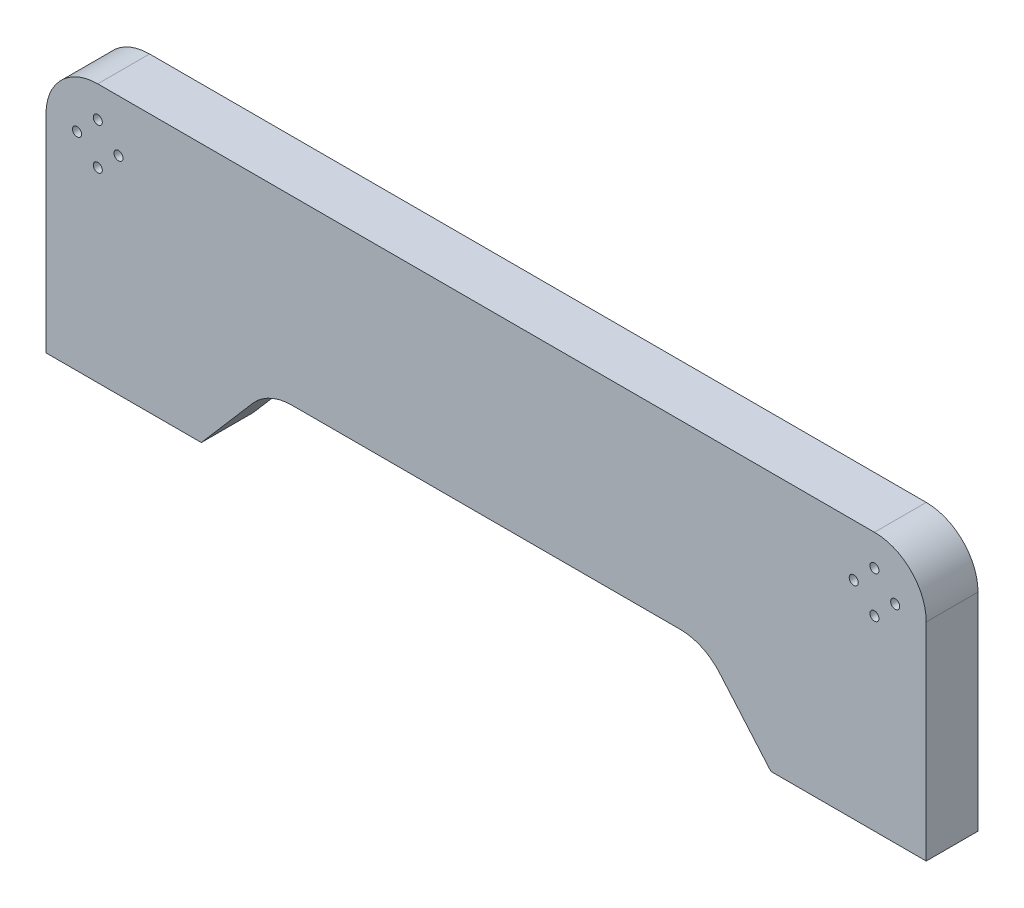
ISO-10303-21;
HEADER;
FILE_DESCRIPTION(('STEP AP214'),'2;1');
FILE_NAME('part.step','',(''),(''),'','','');
FILE_SCHEMA(('AUTOMOTIVE_DESIGN { 1 0 10303 214 1 1 1 1 }'));
ENDSEC;
DATA;
#1=APPLICATION_CONTEXT('core data for automotive mechanical design processes');
#2=APPLICATION_PROTOCOL_DEFINITION('international standard','automotive_design',2000,#1);
#3=PRODUCT_CONTEXT('',#1,'mechanical');
#4=PRODUCT('Part','Part','',(#3));
#5=PRODUCT_RELATED_PRODUCT_CATEGORY('part','',(#4));
#6=PRODUCT_DEFINITION_FORMATION('','',#4);
#7=PRODUCT_DEFINITION_CONTEXT('part definition',#1,'design');
#8=PRODUCT_DEFINITION('design','',#6,#7);
#9=PRODUCT_DEFINITION_SHAPE('','',#8);
#10=(LENGTH_UNIT() NAMED_UNIT(*) SI_UNIT(.MILLI.,.METRE.));
#11=(NAMED_UNIT(*) PLANE_ANGLE_UNIT() SI_UNIT($,.RADIAN.));
#12=(NAMED_UNIT(*) SI_UNIT($,.STERADIAN.) SOLID_ANGLE_UNIT());
#13=UNCERTAINTY_MEASURE_WITH_UNIT(LENGTH_MEASURE(1.E-05),#10,'distance_accuracy_value','');
#14=(GEOMETRIC_REPRESENTATION_CONTEXT(3) GLOBAL_UNCERTAINTY_ASSIGNED_CONTEXT((#13)) GLOBAL_UNIT_ASSIGNED_CONTEXT((#10,
#11,#12)) REPRESENTATION_CONTEXT('',''));
#15=CARTESIAN_POINT('',(0.,0.,0.));
#16=DIRECTION('',(0.,0.,1.));
#17=DIRECTION('',(1.,0.,0.));
#18=AXIS2_PLACEMENT_3D('',#15,#16,#17);
#19=CARTESIAN_POINT('',(95.,9.99999999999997,20.));
#20=DIRECTION('',(0.,0.,-1.));
#21=DIRECTION('',(-1.,0.,0.));
#22=AXIS2_PLACEMENT_3D('',#19,#20,#21);
#23=PLANE('',#22);
#24=DIRECTION('',(0.,-1.,0.));
#25=VECTOR('',#24,1.);
#26=CARTESIAN_POINT('',(0.,80.,20.));
#27=LINE('',#26,#25);
#28=CARTESIAN_POINT('',(0.,80.,20.));
#29=VERTEX_POINT('',#28);
#30=CARTESIAN_POINT('',(0.,0.,20.));
#31=VERTEX_POINT('',#30);
#32=EDGE_CURVE('E206',#29,#31,#27,.T.);
#33=ORIENTED_EDGE('',*,*,#32,.T.);
#34=DIRECTION('',(1.,0.,0.));
#35=VECTOR('',#34,1.);
#36=CARTESIAN_POINT('',(0.,0.,20.));
#37=LINE('',#36,#35);
#38=CARTESIAN_POINT('',(60.,0.,20.));
#39=VERTEX_POINT('',#38);
#40=EDGE_CURVE('E118',#31,#39,#37,.T.);
#41=ORIENTED_EDGE('',*,*,#40,.T.);
#42=DIRECTION('',(0.652440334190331,0.757840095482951,0.));
#43=VECTOR('',#42,1.);
#44=CARTESIAN_POINT('',(60.,0.,20.));
#45=LINE('',#44,#43);
#46=CARTESIAN_POINT('',(79.843198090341,23.0488066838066,20.));
#47=VERTEX_POINT('',#46);
#48=EDGE_CURVE('E243',#39,#47,#45,.T.);
#49=ORIENTED_EDGE('',*,*,#48,.T.);
#50=CARTESIAN_POINT('',(95.,9.99999999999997,20.));
#51=DIRECTION('',(0.,0.,-1.));
#52=DIRECTION('',(-1.,0.,0.));
#53=AXIS2_PLACEMENT_3D('',#50,#51,#52);
#54=CIRCLE('',#53,20.);
#55=CARTESIAN_POINT('',(95.,30.,20.));
#56=VERTEX_POINT('',#55);
#57=EDGE_CURVE('E263',#47,#56,#54,.T.);
#58=ORIENTED_EDGE('',*,*,#57,.T.);
#59=DIRECTION('',(1.,0.,0.));
#60=VECTOR('',#59,1.);
#61=CARTESIAN_POINT('',(95.,30.,20.));
#62=LINE('',#61,#60);
#63=CARTESIAN_POINT('',(245.,30.,20.));
#64=VERTEX_POINT('',#63);
#65=EDGE_CURVE('E259',#56,#64,#62,.T.);
#66=ORIENTED_EDGE('',*,*,#65,.T.);
#67=CARTESIAN_POINT('',(245.,9.99999999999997,20.));
#68=DIRECTION('',(0.,0.,-1.));
#69=DIRECTION('',(-1.,0.,0.));
#70=AXIS2_PLACEMENT_3D('',#67,#68,#69);
#71=CIRCLE('',#70,20.);
#72=CARTESIAN_POINT('',(260.156801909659,23.0488066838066,20.));
#73=VERTEX_POINT('',#72);
#74=EDGE_CURVE('E262',#64,#73,#71,.T.);
#75=ORIENTED_EDGE('',*,*,#74,.T.);
#76=DIRECTION('',(0.652440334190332,-0.757840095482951,0.));
#77=VECTOR('',#76,1.);
#78=CARTESIAN_POINT('',(260.156801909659,23.0488066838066,20.));
#79=LINE('',#78,#77);
#80=CARTESIAN_POINT('',(280.,0.,20.));
#81=VERTEX_POINT('',#80);
#82=EDGE_CURVE('E267',#73,#81,#79,.T.);
#83=ORIENTED_EDGE('',*,*,#82,.T.);
#84=DIRECTION('',(1.,0.,0.));
#85=VECTOR('',#84,1.);
#86=CARTESIAN_POINT('',(280.,0.,20.));
#87=LINE('',#86,#85);
#88=CARTESIAN_POINT('',(340.,0.,20.));
#89=VERTEX_POINT('',#88);
#90=EDGE_CURVE('E274',#81,#89,#87,.T.);
#91=ORIENTED_EDGE('',*,*,#90,.T.);
#92=DIRECTION('',(0.,1.,0.));
#93=VECTOR('',#92,1.);
#94=CARTESIAN_POINT('',(340.,0.,20.));
#95=LINE('',#94,#93);
#96=CARTESIAN_POINT('',(340.,80.,20.));
#97=VERTEX_POINT('',#96);
#98=EDGE_CURVE('E149',#89,#97,#95,.T.);
#99=ORIENTED_EDGE('',*,*,#98,.T.);
#100=CARTESIAN_POINT('',(320.,80.,20.));
#101=DIRECTION('',(0.,0.,1.));
#102=DIRECTION('',(1.,0.,0.));
#103=AXIS2_PLACEMENT_3D('',#100,#101,#102);
#104=CIRCLE('',#103,19.9999999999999);
#105=CARTESIAN_POINT('',(320.,100.,20.));
#106=VERTEX_POINT('',#105);
#107=EDGE_CURVE('E143',#97,#106,#104,.T.);
#108=ORIENTED_EDGE('',*,*,#107,.T.);
#109=DIRECTION('',(-1.,0.,0.));
#110=VECTOR('',#109,1.);
#111=CARTESIAN_POINT('',(320.,100.,20.));
#112=LINE('',#111,#110);
#113=CARTESIAN_POINT('',(20.,100.,20.));
#114=VERTEX_POINT('',#113);
#115=EDGE_CURVE('E147',#106,#114,#112,.T.);
#116=ORIENTED_EDGE('',*,*,#115,.T.);
#117=CARTESIAN_POINT('',(20.,80.,20.));
#118=DIRECTION('',(0.,0.,1.));
#119=DIRECTION('',(1.,0.,0.));
#120=AXIS2_PLACEMENT_3D('',#117,#118,#119);
#121=CIRCLE('',#120,20.);
#122=EDGE_CURVE('E63',#114,#29,#121,.T.);
#123=ORIENTED_EDGE('',*,*,#122,.T.);
#124=EDGE_LOOP('',(#33,#41,#49,#58,#66,#75,#83,#91,#99,#108,#116,#123));
#125=FACE_BOUND('',#124,.T.);
#126=CARTESIAN_POINT('',(12.,80.,20.));
#127=DIRECTION('',(0.,0.,1.));
#128=DIRECTION('',(1.,0.,0.));
#129=AXIS2_PLACEMENT_3D('',#126,#127,#128);
#130=CIRCLE('',#129,1.75);
#131=CARTESIAN_POINT('',(13.75,80.,20.));
#132=VERTEX_POINT('',#131);
#133=EDGE_CURVE('E176',#132,#132,#130,.T.);
#134=ORIENTED_EDGE('',*,*,#133,.F.);
#135=EDGE_LOOP('',(#134));
#136=FACE_BOUND('',#135,.T.);
#137=CARTESIAN_POINT('',(320.,88.,20.));
#138=DIRECTION('',(0.,0.,1.));
#139=DIRECTION('',(-1.,0.,0.));
#140=AXIS2_PLACEMENT_3D('',#137,#138,#139);
#141=CIRCLE('',#140,1.75);
#142=CARTESIAN_POINT('',(318.25,88.,20.));
#143=VERTEX_POINT('',#142);
#144=EDGE_CURVE('E392',#143,#143,#141,.T.);
#145=ORIENTED_EDGE('',*,*,#144,.F.);
#146=EDGE_LOOP('',(#145));
#147=FACE_BOUND('',#146,.T.);
#148=CARTESIAN_POINT('',(328.,80.,20.));
#149=DIRECTION('',(0.,0.,1.));
#150=DIRECTION('',(-1.,0.,0.));
#151=AXIS2_PLACEMENT_3D('',#148,#149,#150);
#152=CIRCLE('',#151,1.74999999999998);
#153=CARTESIAN_POINT('',(326.25,80.,20.));
#154=VERTEX_POINT('',#153);
#155=EDGE_CURVE('E384',#154,#154,#152,.T.);
#156=ORIENTED_EDGE('',*,*,#155,.F.);
#157=EDGE_LOOP('',(#156));
#158=FACE_BOUND('',#157,.T.);
#159=CARTESIAN_POINT('',(20.,88.,20.));
#160=DIRECTION('',(0.,0.,1.));
#161=DIRECTION('',(1.,0.,0.));
#162=AXIS2_PLACEMENT_3D('',#159,#160,#161);
#163=CIRCLE('',#162,1.75);
#164=CARTESIAN_POINT('',(21.75,88.,20.));
#165=VERTEX_POINT('',#164);
#166=EDGE_CURVE('E376',#165,#165,#163,.T.);
#167=ORIENTED_EDGE('',*,*,#166,.F.);
#168=EDGE_LOOP('',(#167));
#169=FACE_BOUND('',#168,.T.);
#170=CARTESIAN_POINT('',(28.,79.9999999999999,20.));
#171=DIRECTION('',(0.,0.,1.));
#172=DIRECTION('',(1.,0.,0.));
#173=AXIS2_PLACEMENT_3D('',#170,#171,#172);
#174=CIRCLE('',#173,1.75);
#175=CARTESIAN_POINT('',(29.75,79.9999999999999,20.));
#176=VERTEX_POINT('',#175);
#177=EDGE_CURVE('E368',#176,#176,#174,.T.);
#178=ORIENTED_EDGE('',*,*,#177,.F.);
#179=EDGE_LOOP('',(#178));
#180=FACE_BOUND('',#179,.T.);
#181=CARTESIAN_POINT('',(19.9999999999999,72.,20.));
#182=DIRECTION('',(0.,0.,1.));
#183=DIRECTION('',(1.,0.,0.));
#184=AXIS2_PLACEMENT_3D('',#181,#182,#183);
#185=CIRCLE('',#184,1.75000000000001);
#186=CARTESIAN_POINT('',(21.7499999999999,72.,20.));
#187=VERTEX_POINT('',#186);
#188=EDGE_CURVE('E360',#187,#187,#185,.T.);
#189=ORIENTED_EDGE('',*,*,#188,.F.);
#190=EDGE_LOOP('',(#189));
#191=FACE_BOUND('',#190,.T.);
#192=CARTESIAN_POINT('',(320.,72.,20.));
#193=DIRECTION('',(0.,0.,1.));
#194=DIRECTION('',(-1.,0.,0.));
#195=AXIS2_PLACEMENT_3D('',#192,#193,#194);
#196=CIRCLE('',#195,1.75000000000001);
#197=CARTESIAN_POINT('',(318.25,72.,20.));
#198=VERTEX_POINT('',#197);
#199=EDGE_CURVE('E352',#198,#198,#196,.T.);
#200=ORIENTED_EDGE('',*,*,#199,.F.);
#201=EDGE_LOOP('',(#200));
#202=FACE_BOUND('',#201,.T.);
#203=CARTESIAN_POINT('',(312.,80.,20.));
#204=DIRECTION('',(0.,0.,1.));
#205=DIRECTION('',(-1.,0.,0.));
#206=AXIS2_PLACEMENT_3D('',#203,#204,#205);
#207=CIRCLE('',#206,1.75000000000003);
#208=CARTESIAN_POINT('',(310.25,80.,20.));
#209=VERTEX_POINT('',#208);
#210=EDGE_CURVE('E341',#209,#209,#207,.T.);
#211=ORIENTED_EDGE('',*,*,#210,.F.);
#212=EDGE_LOOP('',(#211));
#213=FACE_BOUND('',#212,.T.);
#214=ADVANCED_FACE('F45',(#125,#136,#147,#158,#169,#180,#191,#202,#213),#23,.F.);
#215=CARTESIAN_POINT('',(95.,9.99999999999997,0.));
#216=DIRECTION('',(0.,0.,-1.));
#217=DIRECTION('',(-1.,0.,0.));
#218=AXIS2_PLACEMENT_3D('',#215,#216,#217);
#219=PLANE('',#218);
#220=CARTESIAN_POINT('',(320.,72.,0.));
#221=DIRECTION('',(0.,0.,1.));
#222=DIRECTION('',(-1.,0.,0.));
#223=AXIS2_PLACEMENT_3D('',#220,#221,#222);
#224=CIRCLE('',#223,1.75000000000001);
#225=CARTESIAN_POINT('',(318.25,72.,0.));
#226=VERTEX_POINT('',#225);
#227=EDGE_CURVE('E349',#226,#226,#224,.T.);
#228=ORIENTED_EDGE('',*,*,#227,.T.);
#229=EDGE_LOOP('',(#228));
#230=FACE_BOUND('',#229,.T.);
#231=CARTESIAN_POINT('',(28.,79.9999999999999,0.));
#232=DIRECTION('',(0.,0.,1.));
#233=DIRECTION('',(1.,0.,0.));
#234=AXIS2_PLACEMENT_3D('',#231,#232,#233);
#235=CIRCLE('',#234,1.75);
#236=CARTESIAN_POINT('',(29.75,79.9999999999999,0.));
#237=VERTEX_POINT('',#236);
#238=EDGE_CURVE('E364',#237,#237,#235,.T.);
#239=ORIENTED_EDGE('',*,*,#238,.T.);
#240=EDGE_LOOP('',(#239));
#241=FACE_BOUND('',#240,.T.);
#242=CARTESIAN_POINT('',(328.,80.,0.));
#243=DIRECTION('',(0.,0.,1.));
#244=DIRECTION('',(-1.,0.,0.));
#245=AXIS2_PLACEMENT_3D('',#242,#243,#244);
#246=CIRCLE('',#245,1.74999999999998);
#247=CARTESIAN_POINT('',(326.25,80.,0.));
#248=VERTEX_POINT('',#247);
#249=EDGE_CURVE('E380',#248,#248,#246,.T.);
#250=ORIENTED_EDGE('',*,*,#249,.T.);
#251=EDGE_LOOP('',(#250));
#252=FACE_BOUND('',#251,.T.);
#253=CARTESIAN_POINT('',(12.,80.,0.));
#254=DIRECTION('',(0.,0.,1.));
#255=DIRECTION('',(1.,0.,0.));
#256=AXIS2_PLACEMENT_3D('',#253,#254,#255);
#257=CIRCLE('',#256,1.75);
#258=CARTESIAN_POINT('',(13.75,80.,0.));
#259=VERTEX_POINT('',#258);
#260=EDGE_CURVE('E396',#259,#259,#257,.T.);
#261=ORIENTED_EDGE('',*,*,#260,.T.);
#262=EDGE_LOOP('',(#261));
#263=FACE_BOUND('',#262,.T.);
#264=DIRECTION('',(0.,-1.,0.));
#265=VECTOR('',#264,1.);
#266=CARTESIAN_POINT('',(0.,80.,0.));
#267=LINE('',#266,#265);
#268=CARTESIAN_POINT('',(0.,80.,0.));
#269=VERTEX_POINT('',#268);
#270=CARTESIAN_POINT('',(0.,0.,0.));
#271=VERTEX_POINT('',#270);
#272=EDGE_CURVE('E171',#269,#271,#267,.T.);
#273=ORIENTED_EDGE('',*,*,#272,.F.);
#274=CARTESIAN_POINT('',(20.,80.,0.));
#275=DIRECTION('',(0.,0.,1.));
#276=DIRECTION('',(1.,0.,0.));
#277=AXIS2_PLACEMENT_3D('',#274,#275,#276);
#278=CIRCLE('',#277,20.);
#279=CARTESIAN_POINT('',(20.,100.,0.));
#280=VERTEX_POINT('',#279);
#281=EDGE_CURVE('E110',#280,#269,#278,.T.);
#282=ORIENTED_EDGE('',*,*,#281,.F.);
#283=DIRECTION('',(-1.,0.,0.));
#284=VECTOR('',#283,1.);
#285=CARTESIAN_POINT('',(320.,100.,0.));
#286=LINE('',#285,#284);
#287=CARTESIAN_POINT('',(320.,100.,0.));
#288=VERTEX_POINT('',#287);
#289=EDGE_CURVE('E104',#288,#280,#286,.T.);
#290=ORIENTED_EDGE('',*,*,#289,.F.);
#291=CARTESIAN_POINT('',(320.,80.,0.));
#292=DIRECTION('',(0.,0.,1.));
#293=DIRECTION('',(1.,0.,0.));
#294=AXIS2_PLACEMENT_3D('',#291,#292,#293);
#295=CIRCLE('',#294,19.9999999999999);
#296=CARTESIAN_POINT('',(340.,80.,0.));
#297=VERTEX_POINT('',#296);
#298=EDGE_CURVE('E158',#297,#288,#295,.T.);
#299=ORIENTED_EDGE('',*,*,#298,.F.);
#300=DIRECTION('',(0.,1.,0.));
#301=VECTOR('',#300,1.);
#302=CARTESIAN_POINT('',(340.,0.,0.));
#303=LINE('',#302,#301);
#304=CARTESIAN_POINT('',(340.,0.,0.));
#305=VERTEX_POINT('',#304);
#306=EDGE_CURVE('E197',#305,#297,#303,.T.);
#307=ORIENTED_EDGE('',*,*,#306,.F.);
#308=DIRECTION('',(1.,0.,0.));
#309=VECTOR('',#308,1.);
#310=CARTESIAN_POINT('',(280.,0.,0.));
#311=LINE('',#310,#309);
#312=CARTESIAN_POINT('',(280.,0.,0.));
#313=VERTEX_POINT('',#312);
#314=EDGE_CURVE('E194',#313,#305,#311,.T.);
#315=ORIENTED_EDGE('',*,*,#314,.F.);
#316=DIRECTION('',(0.652440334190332,-0.757840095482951,0.));
#317=VECTOR('',#316,1.);
#318=CARTESIAN_POINT('',(260.156801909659,23.0488066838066,0.));
#319=LINE('',#318,#317);
#320=CARTESIAN_POINT('',(260.156801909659,23.0488066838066,0.));
#321=VERTEX_POINT('',#320);
#322=EDGE_CURVE('E191',#321,#313,#319,.T.);
#323=ORIENTED_EDGE('',*,*,#322,.F.);
#324=CARTESIAN_POINT('',(245.,9.99999999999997,0.));
#325=DIRECTION('',(0.,0.,-1.));
#326=DIRECTION('',(-1.,0.,0.));
#327=AXIS2_PLACEMENT_3D('',#324,#325,#326);
#328=CIRCLE('',#327,20.);
#329=CARTESIAN_POINT('',(245.,30.,0.));
#330=VERTEX_POINT('',#329);
#331=EDGE_CURVE('E188',#330,#321,#328,.T.);
#332=ORIENTED_EDGE('',*,*,#331,.F.);
#333=DIRECTION('',(1.,0.,0.));
#334=VECTOR('',#333,1.);
#335=CARTESIAN_POINT('',(95.,30.,0.));
#336=LINE('',#335,#334);
#337=CARTESIAN_POINT('',(95.,30.,0.));
#338=VERTEX_POINT('',#337);
#339=EDGE_CURVE('E185',#338,#330,#336,.T.);
#340=ORIENTED_EDGE('',*,*,#339,.F.);
#341=CARTESIAN_POINT('',(95.,9.99999999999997,0.));
#342=DIRECTION('',(0.,0.,-1.));
#343=DIRECTION('',(-1.,0.,0.));
#344=AXIS2_PLACEMENT_3D('',#341,#342,#343);
#345=CIRCLE('',#344,20.);
#346=CARTESIAN_POINT('',(79.843198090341,23.0488066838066,0.));
#347=VERTEX_POINT('',#346);
#348=EDGE_CURVE('E182',#347,#338,#345,.T.);
#349=ORIENTED_EDGE('',*,*,#348,.F.);
#350=DIRECTION('',(0.652440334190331,0.757840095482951,0.));
#351=VECTOR('',#350,1.);
#352=CARTESIAN_POINT('',(60.,0.,0.));
#353=LINE('',#352,#351);
#354=CARTESIAN_POINT('',(60.,0.,0.));
#355=VERTEX_POINT('',#354);
#356=EDGE_CURVE('E179',#355,#347,#353,.T.);
#357=ORIENTED_EDGE('',*,*,#356,.F.);
#358=DIRECTION('',(1.,0.,0.));
#359=VECTOR('',#358,1.);
#360=CARTESIAN_POINT('',(0.,0.,0.));
#361=LINE('',#360,#359);
#362=EDGE_CURVE('E175',#271,#355,#361,.T.);
#363=ORIENTED_EDGE('',*,*,#362,.F.);
#364=EDGE_LOOP('',(#273,#282,#290,#299,#307,#315,#323,#332,#340,#349,#357,#363));
#365=FACE_BOUND('',#364,.T.);
#366=CARTESIAN_POINT('',(320.,88.,0.));
#367=DIRECTION('',(0.,0.,1.));
#368=DIRECTION('',(-1.,0.,0.));
#369=AXIS2_PLACEMENT_3D('',#366,#367,#368);
#370=CIRCLE('',#369,1.75);
#371=CARTESIAN_POINT('',(318.25,88.,0.));
#372=VERTEX_POINT('',#371);
#373=EDGE_CURVE('E388',#372,#372,#370,.T.);
#374=ORIENTED_EDGE('',*,*,#373,.T.);
#375=EDGE_LOOP('',(#374));
#376=FACE_BOUND('',#375,.T.);
#377=CARTESIAN_POINT('',(20.,88.,0.));
#378=DIRECTION('',(0.,0.,1.));
#379=DIRECTION('',(1.,0.,0.));
#380=AXIS2_PLACEMENT_3D('',#377,#378,#379);
#381=CIRCLE('',#380,1.75);
#382=CARTESIAN_POINT('',(21.75,88.,0.));
#383=VERTEX_POINT('',#382);
#384=EDGE_CURVE('E372',#383,#383,#381,.T.);
#385=ORIENTED_EDGE('',*,*,#384,.T.);
#386=EDGE_LOOP('',(#385));
#387=FACE_BOUND('',#386,.T.);
#388=CARTESIAN_POINT('',(19.9999999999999,72.,0.));
#389=DIRECTION('',(0.,0.,1.));
#390=DIRECTION('',(1.,0.,0.));
#391=AXIS2_PLACEMENT_3D('',#388,#389,#390);
#392=CIRCLE('',#391,1.75000000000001);
#393=CARTESIAN_POINT('',(21.7499999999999,72.,0.));
#394=VERTEX_POINT('',#393);
#395=EDGE_CURVE('E356',#394,#394,#392,.T.);
#396=ORIENTED_EDGE('',*,*,#395,.T.);
#397=EDGE_LOOP('',(#396));
#398=FACE_BOUND('',#397,.T.);
#399=CARTESIAN_POINT('',(312.,80.,0.));
#400=DIRECTION('',(0.,0.,1.));
#401=DIRECTION('',(-1.,0.,0.));
#402=AXIS2_PLACEMENT_3D('',#399,#400,#401);
#403=CIRCLE('',#402,1.75000000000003);
#404=CARTESIAN_POINT('',(310.25,80.,0.));
#405=VERTEX_POINT('',#404);
#406=EDGE_CURVE('E344',#405,#405,#403,.T.);
#407=ORIENTED_EDGE('',*,*,#406,.T.);
#408=EDGE_LOOP('',(#407));
#409=FACE_BOUND('',#408,.T.);
#410=ADVANCED_FACE('F247',(#230,#241,#252,#263,#365,#376,#387,#398,#409),#219,.T.);
#411=CARTESIAN_POINT('',(0.,80.,20.));
#412=DIRECTION('',(1.,0.,0.));
#413=DIRECTION('',(0.,0.,-1.));
#414=AXIS2_PLACEMENT_3D('',#411,#412,#413);
#415=PLANE('',#414);
#416=ORIENTED_EDGE('',*,*,#272,.T.);
#417=DIRECTION('',(0.,0.,-1.));
#418=VECTOR('',#417,1.);
#419=CARTESIAN_POINT('',(0.,0.,20.));
#420=LINE('',#419,#418);
#421=EDGE_CURVE('E11',#31,#271,#420,.T.);
#422=ORIENTED_EDGE('',*,*,#421,.F.);
#423=ORIENTED_EDGE('',*,*,#32,.F.);
#424=DIRECTION('',(0.,0.,-1.));
#425=VECTOR('',#424,1.);
#426=CARTESIAN_POINT('',(0.,80.,20.));
#427=LINE('',#426,#425);
#428=EDGE_CURVE('E167',#29,#269,#427,.T.);
#429=ORIENTED_EDGE('',*,*,#428,.T.);
#430=EDGE_LOOP('',(#416,#422,#423,#429));
#431=FACE_BOUND('',#430,.T.);
#432=ADVANCED_FACE('F47',(#431),#415,.F.);
#433=CARTESIAN_POINT('',(0.,0.,20.));
#434=DIRECTION('',(0.,1.,0.));
#435=DIRECTION('',(0.,0.,1.));
#436=AXIS2_PLACEMENT_3D('',#433,#434,#435);
#437=PLANE('',#436);
#438=ORIENTED_EDGE('',*,*,#362,.T.);
#439=DIRECTION('',(0.,0.,-1.));
#440=VECTOR('',#439,1.);
#441=CARTESIAN_POINT('',(60.,0.,20.));
#442=LINE('',#441,#440);
#443=EDGE_CURVE('E55',#39,#355,#442,.T.);
#444=ORIENTED_EDGE('',*,*,#443,.F.);
#445=ORIENTED_EDGE('',*,*,#40,.F.);
#446=ORIENTED_EDGE('',*,*,#421,.T.);
#447=EDGE_LOOP('',(#438,#444,#445,#446));
#448=FACE_BOUND('',#447,.T.);
#449=ADVANCED_FACE('F558',(#448),#437,.F.);
#450=CARTESIAN_POINT('',(60.,0.,20.));
#451=DIRECTION('',(-0.757840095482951,0.652440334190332,0.));
#452=DIRECTION('',(-0.652440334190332,-0.757840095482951,0.));
#453=AXIS2_PLACEMENT_3D('',#450,#451,#452);
#454=PLANE('',#453);
#455=ORIENTED_EDGE('',*,*,#356,.T.);
#456=DIRECTION('',(0.,0.,-1.));
#457=VECTOR('',#456,1.);
#458=CARTESIAN_POINT('',(79.843198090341,23.0488066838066,20.));
#459=LINE('',#458,#457);
#460=EDGE_CURVE('E233',#47,#347,#459,.T.);
#461=ORIENTED_EDGE('',*,*,#460,.F.);
#462=ORIENTED_EDGE('',*,*,#48,.F.);
#463=ORIENTED_EDGE('',*,*,#443,.T.);
#464=EDGE_LOOP('',(#455,#461,#462,#463));
#465=FACE_BOUND('',#464,.T.);
#466=ADVANCED_FACE('F241',(#465),#454,.F.);
#467=CARTESIAN_POINT('',(95.,9.99999999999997,20.));
#468=DIRECTION('',(0.,0.,-1.));
#469=DIRECTION('',(-1.,0.,0.));
#470=AXIS2_PLACEMENT_3D('',#467,#468,#469);
#471=CYLINDRICAL_SURFACE('',#470,20.);
#472=ORIENTED_EDGE('',*,*,#348,.T.);
#473=DIRECTION('',(0.,0.,-1.));
#474=VECTOR('',#473,1.);
#475=CARTESIAN_POINT('',(95.,30.,20.));
#476=LINE('',#475,#474);
#477=EDGE_CURVE('E229',#56,#338,#476,.T.);
#478=ORIENTED_EDGE('',*,*,#477,.F.);
#479=ORIENTED_EDGE('',*,*,#57,.F.);
#480=ORIENTED_EDGE('',*,*,#460,.T.);
#481=EDGE_LOOP('',(#472,#478,#479,#480));
#482=FACE_BOUND('',#481,.T.);
#483=ADVANCED_FACE('F253',(#482),#471,.F.);
#484=CARTESIAN_POINT('',(95.,30.,20.));
#485=DIRECTION('',(0.,1.,0.));
#486=DIRECTION('',(-1.,0.,0.));
#487=AXIS2_PLACEMENT_3D('',#484,#485,#486);
#488=PLANE('',#487);
#489=ORIENTED_EDGE('',*,*,#339,.T.);
#490=DIRECTION('',(0.,0.,-1.));
#491=VECTOR('',#490,1.);
#492=CARTESIAN_POINT('',(245.,30.,20.));
#493=LINE('',#492,#491);
#494=EDGE_CURVE('E225',#64,#330,#493,.T.);
#495=ORIENTED_EDGE('',*,*,#494,.F.);
#496=ORIENTED_EDGE('',*,*,#65,.F.);
#497=ORIENTED_EDGE('',*,*,#477,.T.);
#498=EDGE_LOOP('',(#489,#495,#496,#497));
#499=FACE_BOUND('',#498,.T.);
#500=ADVANCED_FACE('F257',(#499),#488,.F.);
#501=CARTESIAN_POINT('',(245.,9.99999999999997,20.));
#502=DIRECTION('',(0.,0.,-1.));
#503=DIRECTION('',(-1.,0.,0.));
#504=AXIS2_PLACEMENT_3D('',#501,#502,#503);
#505=CYLINDRICAL_SURFACE('',#504,20.);
#506=ORIENTED_EDGE('',*,*,#331,.T.);
#507=DIRECTION('',(0.,0.,-1.));
#508=VECTOR('',#507,1.);
#509=CARTESIAN_POINT('',(260.156801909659,23.0488066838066,20.));
#510=LINE('',#509,#508);
#511=EDGE_CURVE('E221',#73,#321,#510,.T.);
#512=ORIENTED_EDGE('',*,*,#511,.F.);
#513=ORIENTED_EDGE('',*,*,#74,.F.);
#514=ORIENTED_EDGE('',*,*,#494,.T.);
#515=EDGE_LOOP('',(#506,#512,#513,#514));
#516=FACE_BOUND('',#515,.T.);
#517=ADVANCED_FACE('F523',(#516),#505,.F.);
#518=CARTESIAN_POINT('',(260.156801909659,23.0488066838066,20.));
#519=DIRECTION('',(0.757840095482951,0.652440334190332,0.));
#520=DIRECTION('',(-0.652440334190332,0.757840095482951,0.));
#521=AXIS2_PLACEMENT_3D('',#518,#519,#520);
#522=PLANE('',#521);
#523=ORIENTED_EDGE('',*,*,#322,.T.);
#524=DIRECTION('',(0.,0.,-1.));
#525=VECTOR('',#524,1.);
#526=CARTESIAN_POINT('',(280.,0.,20.));
#527=LINE('',#526,#525);
#528=EDGE_CURVE('E217',#81,#313,#527,.T.);
#529=ORIENTED_EDGE('',*,*,#528,.F.);
#530=ORIENTED_EDGE('',*,*,#82,.F.);
#531=ORIENTED_EDGE('',*,*,#511,.T.);
#532=EDGE_LOOP('',(#523,#529,#530,#531));
#533=FACE_BOUND('',#532,.T.);
#534=ADVANCED_FACE('F514',(#533),#522,.F.);
#535=CARTESIAN_POINT('',(280.,0.,20.));
#536=DIRECTION('',(0.,1.,0.));
#537=DIRECTION('',(0.,0.,1.));
#538=AXIS2_PLACEMENT_3D('',#535,#536,#537);
#539=PLANE('',#538);
#540=ORIENTED_EDGE('',*,*,#314,.T.);
#541=DIRECTION('',(0.,0.,-1.));
#542=VECTOR('',#541,1.);
#543=CARTESIAN_POINT('',(340.,0.,20.));
#544=LINE('',#543,#542);
#545=EDGE_CURVE('E213',#89,#305,#544,.T.);
#546=ORIENTED_EDGE('',*,*,#545,.F.);
#547=ORIENTED_EDGE('',*,*,#90,.F.);
#548=ORIENTED_EDGE('',*,*,#528,.T.);
#549=EDGE_LOOP('',(#540,#546,#547,#548));
#550=FACE_BOUND('',#549,.T.);
#551=ADVANCED_FACE('F282',(#550),#539,.F.);
#552=CARTESIAN_POINT('',(340.,0.,20.));
#553=DIRECTION('',(-1.,0.,0.));
#554=DIRECTION('',(0.,-1.,0.));
#555=AXIS2_PLACEMENT_3D('',#552,#553,#554);
#556=PLANE('',#555);
#557=ORIENTED_EDGE('',*,*,#306,.T.);
#558=DIRECTION('',(0.,0.,-1.));
#559=VECTOR('',#558,1.);
#560=CARTESIAN_POINT('',(340.,80.,20.));
#561=LINE('',#560,#559);
#562=EDGE_CURVE('E160',#97,#297,#561,.T.);
#563=ORIENTED_EDGE('',*,*,#562,.F.);
#564=ORIENTED_EDGE('',*,*,#98,.F.);
#565=ORIENTED_EDGE('',*,*,#545,.T.);
#566=EDGE_LOOP('',(#557,#563,#564,#565));
#567=FACE_BOUND('',#566,.T.);
#568=ADVANCED_FACE('F286',(#567),#556,.F.);
#569=CARTESIAN_POINT('',(320.,80.,20.));
#570=DIRECTION('',(0.,0.,-1.));
#571=DIRECTION('',(-1.,0.,0.));
#572=AXIS2_PLACEMENT_3D('',#569,#570,#571);
#573=CYLINDRICAL_SURFACE('',#572,19.9999999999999);
#574=ORIENTED_EDGE('',*,*,#298,.T.);
#575=DIRECTION('',(0.,0.,-1.));
#576=VECTOR('',#575,1.);
#577=CARTESIAN_POINT('',(320.,100.,20.));
#578=LINE('',#577,#576);
#579=EDGE_CURVE('E155',#106,#288,#578,.T.);
#580=ORIENTED_EDGE('',*,*,#579,.F.);
#581=ORIENTED_EDGE('',*,*,#107,.F.);
#582=ORIENTED_EDGE('',*,*,#562,.T.);
#583=EDGE_LOOP('',(#574,#580,#581,#582));
#584=FACE_BOUND('',#583,.T.);
#585=ADVANCED_FACE('F156',(#584),#573,.T.);
#586=CARTESIAN_POINT('',(320.,100.,20.));
#587=DIRECTION('',(0.,-1.,0.));
#588=DIRECTION('',(1.,0.,0.));
#589=AXIS2_PLACEMENT_3D('',#586,#587,#588);
#590=PLANE('',#589);
#591=ORIENTED_EDGE('',*,*,#289,.T.);
#592=DIRECTION('',(0.,0.,-1.));
#593=VECTOR('',#592,1.);
#594=CARTESIAN_POINT('',(20.,100.,20.));
#595=LINE('',#594,#593);
#596=EDGE_CURVE('E161',#114,#280,#595,.T.);
#597=ORIENTED_EDGE('',*,*,#596,.F.);
#598=ORIENTED_EDGE('',*,*,#115,.F.);
#599=ORIENTED_EDGE('',*,*,#579,.T.);
#600=EDGE_LOOP('',(#591,#597,#598,#599));
#601=FACE_BOUND('',#600,.T.);
#602=ADVANCED_FACE('F163',(#601),#590,.F.);
#603=CARTESIAN_POINT('',(20.,80.,20.));
#604=DIRECTION('',(0.,0.,-1.));
#605=DIRECTION('',(-1.,0.,0.));
#606=AXIS2_PLACEMENT_3D('',#603,#604,#605);
#607=CYLINDRICAL_SURFACE('',#606,20.);
#608=ORIENTED_EDGE('',*,*,#281,.T.);
#609=ORIENTED_EDGE('',*,*,#428,.F.);
#610=ORIENTED_EDGE('',*,*,#122,.F.);
#611=ORIENTED_EDGE('',*,*,#596,.T.);
#612=EDGE_LOOP('',(#608,#609,#610,#611));
#613=FACE_BOUND('',#612,.T.);
#614=ADVANCED_FACE('F290',(#613),#607,.T.);
#615=CARTESIAN_POINT('',(12.,80.,20.));
#616=DIRECTION('',(0.,0.,-1.));
#617=DIRECTION('',(-1.,0.,0.));
#618=AXIS2_PLACEMENT_3D('',#615,#616,#617);
#619=CYLINDRICAL_SURFACE('',#618,1.75);
#620=ORIENTED_EDGE('',*,*,#133,.T.);
#621=EDGE_LOOP('',(#620));
#622=FACE_BOUND('',#621,.T.);
#623=ORIENTED_EDGE('',*,*,#260,.F.);
#624=EDGE_LOOP('',(#623));
#625=FACE_BOUND('',#624,.T.);
#626=ADVANCED_FACE('F292',(#622,#625),#619,.F.);
#627=CARTESIAN_POINT('',(320.,88.,20.));
#628=DIRECTION('',(0.,0.,-1.));
#629=DIRECTION('',(-1.,0.,0.));
#630=AXIS2_PLACEMENT_3D('',#627,#628,#629);
#631=CYLINDRICAL_SURFACE('',#630,1.75);
#632=ORIENTED_EDGE('',*,*,#144,.T.);
#633=EDGE_LOOP('',(#632));
#634=FACE_BOUND('',#633,.T.);
#635=ORIENTED_EDGE('',*,*,#373,.F.);
#636=EDGE_LOOP('',(#635));
#637=FACE_BOUND('',#636,.T.);
#638=ADVANCED_FACE('F298',(#634,#637),#631,.F.);
#639=CARTESIAN_POINT('',(328.,80.,20.));
#640=DIRECTION('',(0.,0.,-1.));
#641=DIRECTION('',(-1.,0.,0.));
#642=AXIS2_PLACEMENT_3D('',#639,#640,#641);
#643=CYLINDRICAL_SURFACE('',#642,1.74999999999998);
#644=ORIENTED_EDGE('',*,*,#155,.T.);
#645=EDGE_LOOP('',(#644));
#646=FACE_BOUND('',#645,.T.);
#647=ORIENTED_EDGE('',*,*,#249,.F.);
#648=EDGE_LOOP('',(#647));
#649=FACE_BOUND('',#648,.T.);
#650=ADVANCED_FACE('F312',(#646,#649),#643,.F.);
#651=CARTESIAN_POINT('',(20.,88.,20.));
#652=DIRECTION('',(0.,0.,-1.));
#653=DIRECTION('',(-1.,0.,0.));
#654=AXIS2_PLACEMENT_3D('',#651,#652,#653);
#655=CYLINDRICAL_SURFACE('',#654,1.75);
#656=ORIENTED_EDGE('',*,*,#166,.T.);
#657=EDGE_LOOP('',(#656));
#658=FACE_BOUND('',#657,.T.);
#659=ORIENTED_EDGE('',*,*,#384,.F.);
#660=EDGE_LOOP('',(#659));
#661=FACE_BOUND('',#660,.T.);
#662=ADVANCED_FACE('F316',(#658,#661),#655,.F.);
#663=CARTESIAN_POINT('',(28.,79.9999999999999,20.));
#664=DIRECTION('',(0.,0.,-1.));
#665=DIRECTION('',(-1.,0.,0.));
#666=AXIS2_PLACEMENT_3D('',#663,#664,#665);
#667=CYLINDRICAL_SURFACE('',#666,1.75);
#668=ORIENTED_EDGE('',*,*,#177,.T.);
#669=EDGE_LOOP('',(#668));
#670=FACE_BOUND('',#669,.T.);
#671=ORIENTED_EDGE('',*,*,#238,.F.);
#672=EDGE_LOOP('',(#671));
#673=FACE_BOUND('',#672,.T.);
#674=ADVANCED_FACE('F320',(#670,#673),#667,.F.);
#675=CARTESIAN_POINT('',(19.9999999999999,72.,20.));
#676=DIRECTION('',(0.,0.,-1.));
#677=DIRECTION('',(-1.,0.,0.));
#678=AXIS2_PLACEMENT_3D('',#675,#676,#677);
#679=CYLINDRICAL_SURFACE('',#678,1.75000000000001);
#680=ORIENTED_EDGE('',*,*,#188,.T.);
#681=EDGE_LOOP('',(#680));
#682=FACE_BOUND('',#681,.T.);
#683=ORIENTED_EDGE('',*,*,#395,.F.);
#684=EDGE_LOOP('',(#683));
#685=FACE_BOUND('',#684,.T.);
#686=ADVANCED_FACE('F324',(#682,#685),#679,.F.);
#687=CARTESIAN_POINT('',(320.,72.,20.));
#688=DIRECTION('',(0.,0.,-1.));
#689=DIRECTION('',(-1.,0.,0.));
#690=AXIS2_PLACEMENT_3D('',#687,#688,#689);
#691=CYLINDRICAL_SURFACE('',#690,1.75000000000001);
#692=ORIENTED_EDGE('',*,*,#199,.T.);
#693=EDGE_LOOP('',(#692));
#694=FACE_BOUND('',#693,.T.);
#695=ORIENTED_EDGE('',*,*,#227,.F.);
#696=EDGE_LOOP('',(#695));
#697=FACE_BOUND('',#696,.T.);
#698=ADVANCED_FACE('F328',(#694,#697),#691,.F.);
#699=CARTESIAN_POINT('',(312.,80.,20.));
#700=DIRECTION('',(0.,0.,-1.));
#701=DIRECTION('',(-1.,0.,0.));
#702=AXIS2_PLACEMENT_3D('',#699,#700,#701);
#703=CYLINDRICAL_SURFACE('',#702,1.75000000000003);
#704=ORIENTED_EDGE('',*,*,#210,.T.);
#705=EDGE_LOOP('',(#704));
#706=FACE_BOUND('',#705,.T.);
#707=ORIENTED_EDGE('',*,*,#406,.F.);
#708=EDGE_LOOP('',(#707));
#709=FACE_BOUND('',#708,.T.);
#710=ADVANCED_FACE('F332',(#706,#709),#703,.F.);
#711=CLOSED_SHELL('',(#214,#410,#432,#449,#466,#483,#500,#517,#534,#551,#568,#585,#602,#614,
#626,#638,#650,#662,#674,#686,#698,#710));
#712=MANIFOLD_SOLID_BREP('B2',#711);
#713=ADVANCED_BREP_SHAPE_REPRESENTATION('',(#18,#712),#14);
#714=SHAPE_DEFINITION_REPRESENTATION(#9,#713);
ENDSEC;
END-ISO-10303-21;
